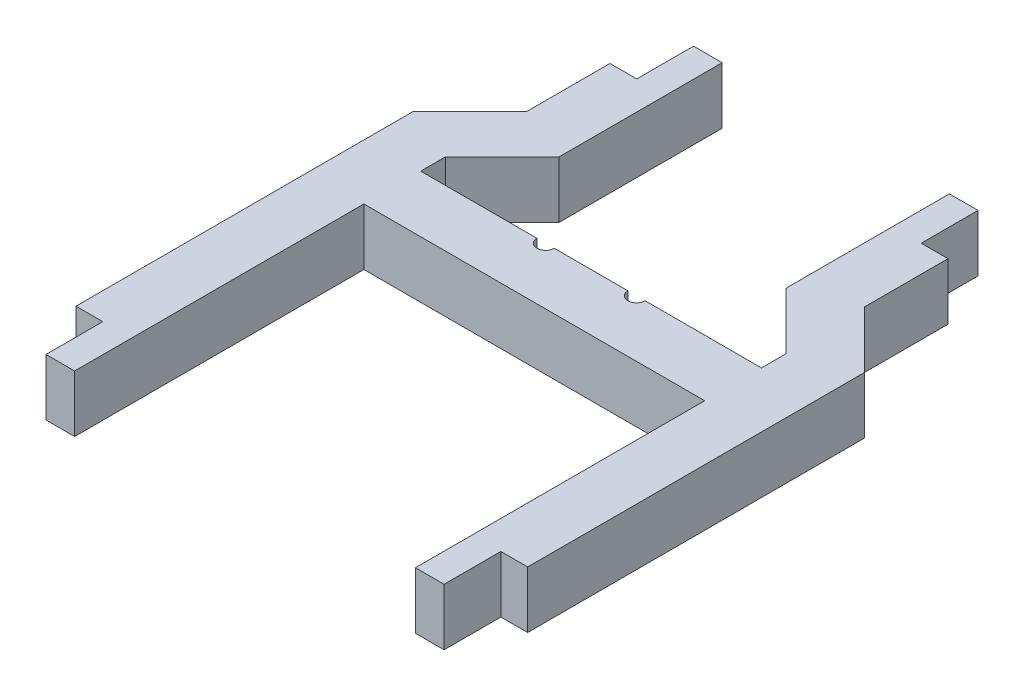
from build123d import *

# Parameters (mm, degrees)
BOSS_EXTRUDE1_DEPTH = 6.35


with BuildPart() as part:
    # Sketch1 → Boss-Extrude1 (new body)
    with BuildSketch(Plane(origin=(0, 0, 0), x_dir=(1, 0, 0), z_dir=(0, 1, 0))):
        Polygon((-19.05, 7.62), (-22.2504, 7.62), (-22.2504, 13.97), (-25.2476, 13.97), (-25.2476, 22.809013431), (-25.2476, 51.638235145), (-18.8976, 57.988235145), (-18.8976, 62.997221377), (-18.8976, 67.31), (-15.9004, 67.31), (-15.9004, 73.66), (-12.7, 73.66), (-12.7, 55.421105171), (-19.05, 49.071105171), align=None)
        with BuildLine():
            Line((-19.05, 39.956006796), (19.05, 39.956006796))
            Line((19.05, 39.956006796), (19.05, 46.306006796))
            Line((19.05, 46.306006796), (6.046016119, 46.306006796))
            ThreePointArc((6.046016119, 46.306006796), (5.08, 45.339990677), (4.113983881, 46.306006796))
            Line((4.113983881, 46.306006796), (-4.113983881, 46.306006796))
            ThreePointArc((-4.113983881, 46.306006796), (-5.08, 45.339990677), (-6.046016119, 46.306006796))
            Line((-6.046016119, 46.306006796), (-19.05, 46.306006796))
            Line((-19.05, 46.306006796), (-19.05, 39.956006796))
        make_face()
        Polygon((18.8976, 57.988235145), (25.2476, 51.638235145), (25.2476, 22.809013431), (25.2476, 13.97), (22.2504, 13.97), (22.2504, 7.62), (19.05, 7.62), (19.05, 49.071105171), (12.7, 55.421105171), (12.7, 73.66), (15.9004, 73.66), (15.9004, 67.31), (18.8976, 67.31), (18.8976, 62.997221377), align=None)
    extrude(amount=BOSS_EXTRUDE1_DEPTH)


solid = part.part
